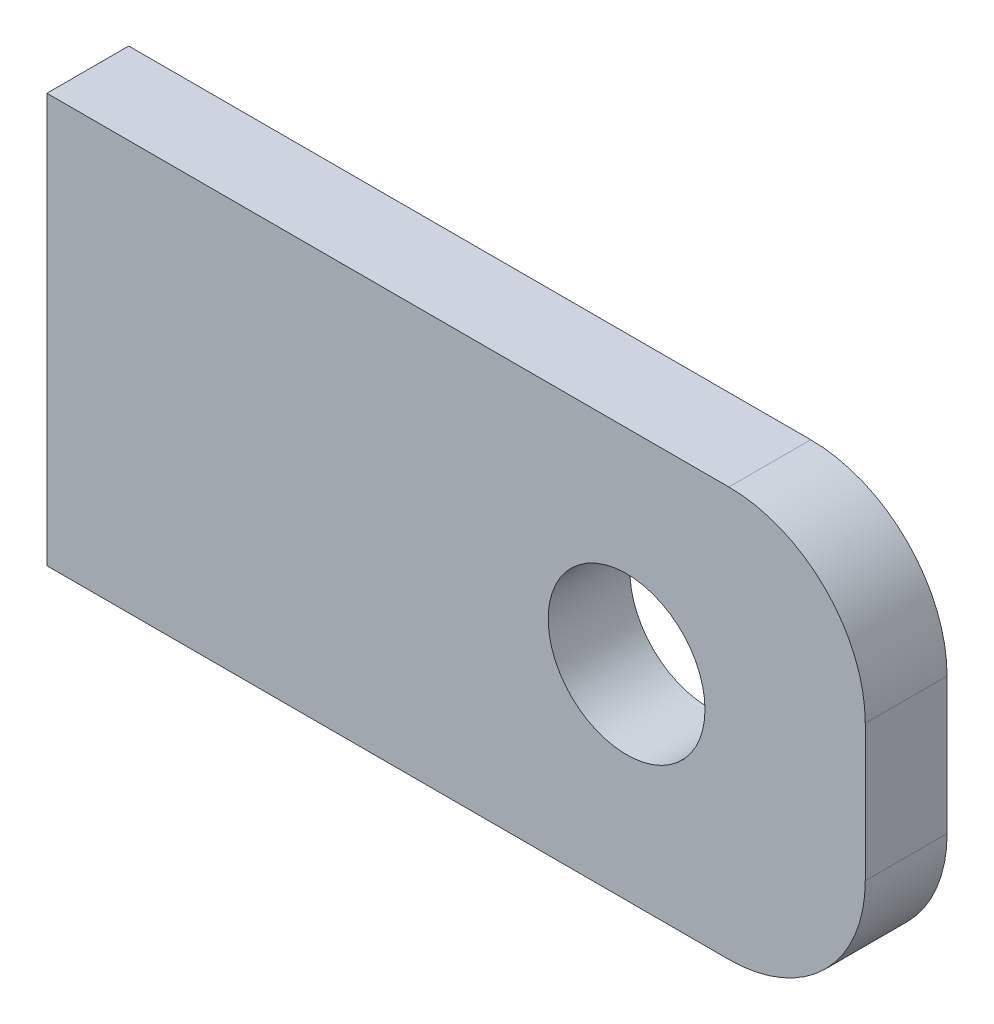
ISO-10303-21;
HEADER;
FILE_DESCRIPTION(('STEP AP214'),'2;1');
FILE_NAME('part.step','',(''),(''),'','','');
FILE_SCHEMA(('AUTOMOTIVE_DESIGN { 1 0 10303 214 1 1 1 1 }'));
ENDSEC;
DATA;
#1=APPLICATION_CONTEXT('core data for automotive mechanical design processes');
#2=APPLICATION_PROTOCOL_DEFINITION('international standard','automotive_design',2000,#1);
#3=PRODUCT_CONTEXT('',#1,'mechanical');
#4=PRODUCT('Part','Part','',(#3));
#5=PRODUCT_RELATED_PRODUCT_CATEGORY('part','',(#4));
#6=PRODUCT_DEFINITION_FORMATION('','',#4);
#7=PRODUCT_DEFINITION_CONTEXT('part definition',#1,'design');
#8=PRODUCT_DEFINITION('design','',#6,#7);
#9=PRODUCT_DEFINITION_SHAPE('','',#8);
#10=(LENGTH_UNIT() NAMED_UNIT(*) SI_UNIT(.MILLI.,.METRE.));
#11=(NAMED_UNIT(*) PLANE_ANGLE_UNIT() SI_UNIT($,.RADIAN.));
#12=(NAMED_UNIT(*) SI_UNIT($,.STERADIAN.) SOLID_ANGLE_UNIT());
#13=UNCERTAINTY_MEASURE_WITH_UNIT(LENGTH_MEASURE(1.E-05),#10,'distance_accuracy_value','');
#14=(GEOMETRIC_REPRESENTATION_CONTEXT(3) GLOBAL_UNCERTAINTY_ASSIGNED_CONTEXT((#13)) GLOBAL_UNIT_ASSIGNED_CONTEXT((#10,
#11,#12)) REPRESENTATION_CONTEXT('',''));
#15=CARTESIAN_POINT('',(0.,0.,0.));
#16=DIRECTION('',(0.,0.,1.));
#17=DIRECTION('',(1.,0.,0.));
#18=AXIS2_PLACEMENT_3D('',#15,#16,#17);
#19=CARTESIAN_POINT('',(100.,-40.,12.));
#20=DIRECTION('',(0.,0.,1.));
#21=DIRECTION('',(1.,0.,0.));
#22=AXIS2_PLACEMENT_3D('',#19,#20,#21);
#23=PLANE('',#22);
#24=DIRECTION('',(0.,-1.,0.));
#25=VECTOR('',#24,1.);
#26=CARTESIAN_POINT('',(0.,0.,12.));
#27=LINE('',#26,#25);
#28=CARTESIAN_POINT('',(0.,0.,12.));
#29=VERTEX_POINT('',#28);
#30=CARTESIAN_POINT('',(0.,-60.,12.));
#31=VERTEX_POINT('',#30);
#32=EDGE_CURVE('E115',#29,#31,#27,.T.);
#33=ORIENTED_EDGE('',*,*,#32,.T.);
#34=DIRECTION('',(1.,0.,0.));
#35=VECTOR('',#34,1.);
#36=CARTESIAN_POINT('',(0.,-60.,12.));
#37=LINE('',#36,#35);
#38=CARTESIAN_POINT('',(99.9999999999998,-60.,12.));
#39=VERTEX_POINT('',#38);
#40=EDGE_CURVE('E96',#31,#39,#37,.T.);
#41=ORIENTED_EDGE('',*,*,#40,.T.);
#42=CARTESIAN_POINT('',(100.,-40.,12.));
#43=DIRECTION('',(0.,0.,1.));
#44=DIRECTION('',(1.,0.,0.));
#45=AXIS2_PLACEMENT_3D('',#42,#43,#44);
#46=CIRCLE('',#45,20.);
#47=CARTESIAN_POINT('',(120.,-39.9999999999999,12.));
#48=VERTEX_POINT('',#47);
#49=EDGE_CURVE('E118',#39,#48,#46,.T.);
#50=ORIENTED_EDGE('',*,*,#49,.T.);
#51=DIRECTION('',(0.,1.,0.));
#52=VECTOR('',#51,1.);
#53=CARTESIAN_POINT('',(120.,-20.0000000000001,12.));
#54=LINE('',#53,#52);
#55=CARTESIAN_POINT('',(120.,-20.0000000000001,12.));
#56=VERTEX_POINT('',#55);
#57=EDGE_CURVE('E120',#48,#56,#54,.T.);
#58=ORIENTED_EDGE('',*,*,#57,.T.);
#59=CARTESIAN_POINT('',(100.,-20.,12.));
#60=DIRECTION('',(0.,0.,1.));
#61=DIRECTION('',(1.,0.,0.));
#62=AXIS2_PLACEMENT_3D('',#59,#60,#61);
#63=CIRCLE('',#62,20.);
#64=CARTESIAN_POINT('',(99.9999999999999,0.,12.));
#65=VERTEX_POINT('',#64);
#66=EDGE_CURVE('E49',#56,#65,#63,.T.);
#67=ORIENTED_EDGE('',*,*,#66,.T.);
#68=DIRECTION('',(-1.,0.,0.));
#69=VECTOR('',#68,1.);
#70=CARTESIAN_POINT('',(0.,0.,12.));
#71=LINE('',#70,#69);
#72=EDGE_CURVE('E44',#65,#29,#71,.T.);
#73=ORIENTED_EDGE('',*,*,#72,.T.);
#74=EDGE_LOOP('',(#33,#41,#50,#58,#67,#73));
#75=FACE_BOUND('',#74,.T.);
#76=CARTESIAN_POINT('',(85.,-30.,12.));
#77=DIRECTION('',(0.,0.,1.));
#78=DIRECTION('',(1.,0.,0.));
#79=AXIS2_PLACEMENT_3D('',#76,#77,#78);
#80=CIRCLE('',#79,11.5);
#81=CARTESIAN_POINT('',(96.5,-30.,12.));
#82=VERTEX_POINT('',#81);
#83=EDGE_CURVE('E101',#82,#82,#80,.T.);
#84=ORIENTED_EDGE('',*,*,#83,.F.);
#85=EDGE_LOOP('',(#84));
#86=FACE_BOUND('',#85,.T.);
#87=ADVANCED_FACE('F29',(#75,#86),#23,.T.);
#88=CARTESIAN_POINT('',(100.,-40.,0.));
#89=DIRECTION('',(0.,0.,1.));
#90=DIRECTION('',(1.,0.,0.));
#91=AXIS2_PLACEMENT_3D('',#88,#89,#90);
#92=PLANE('',#91);
#93=DIRECTION('',(0.,-1.,0.));
#94=VECTOR('',#93,1.);
#95=CARTESIAN_POINT('',(0.,0.,0.));
#96=LINE('',#95,#94);
#97=CARTESIAN_POINT('',(0.,0.,0.));
#98=VERTEX_POINT('',#97);
#99=CARTESIAN_POINT('',(0.,-60.,0.));
#100=VERTEX_POINT('',#99);
#101=EDGE_CURVE('E87',#98,#100,#96,.T.);
#102=ORIENTED_EDGE('',*,*,#101,.F.);
#103=DIRECTION('',(-1.,0.,0.));
#104=VECTOR('',#103,1.);
#105=CARTESIAN_POINT('',(0.,0.,0.));
#106=LINE('',#105,#104);
#107=CARTESIAN_POINT('',(99.9999999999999,0.,0.));
#108=VERTEX_POINT('',#107);
#109=EDGE_CURVE('E113',#108,#98,#106,.T.);
#110=ORIENTED_EDGE('',*,*,#109,.F.);
#111=CARTESIAN_POINT('',(100.,-20.,0.));
#112=DIRECTION('',(0.,0.,1.));
#113=DIRECTION('',(1.,0.,0.));
#114=AXIS2_PLACEMENT_3D('',#111,#112,#113);
#115=CIRCLE('',#114,20.);
#116=CARTESIAN_POINT('',(120.,-20.0000000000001,0.));
#117=VERTEX_POINT('',#116);
#118=EDGE_CURVE('E111',#117,#108,#115,.T.);
#119=ORIENTED_EDGE('',*,*,#118,.F.);
#120=DIRECTION('',(0.,1.,0.));
#121=VECTOR('',#120,1.);
#122=CARTESIAN_POINT('',(120.,-20.0000000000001,0.));
#123=LINE('',#122,#121);
#124=CARTESIAN_POINT('',(120.,-39.9999999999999,0.));
#125=VERTEX_POINT('',#124);
#126=EDGE_CURVE('E109',#125,#117,#123,.T.);
#127=ORIENTED_EDGE('',*,*,#126,.F.);
#128=CARTESIAN_POINT('',(100.,-40.,0.));
#129=DIRECTION('',(0.,0.,1.));
#130=DIRECTION('',(1.,0.,0.));
#131=AXIS2_PLACEMENT_3D('',#128,#129,#130);
#132=CIRCLE('',#131,20.);
#133=CARTESIAN_POINT('',(99.9999999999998,-60.,0.));
#134=VERTEX_POINT('',#133);
#135=EDGE_CURVE('E89',#134,#125,#132,.T.);
#136=ORIENTED_EDGE('',*,*,#135,.F.);
#137=DIRECTION('',(1.,0.,0.));
#138=VECTOR('',#137,1.);
#139=CARTESIAN_POINT('',(0.,-60.,0.));
#140=LINE('',#139,#138);
#141=EDGE_CURVE('E82',#100,#134,#140,.T.);
#142=ORIENTED_EDGE('',*,*,#141,.F.);
#143=EDGE_LOOP('',(#102,#110,#119,#127,#136,#142));
#144=FACE_BOUND('',#143,.T.);
#145=CARTESIAN_POINT('',(85.,-30.,0.));
#146=DIRECTION('',(0.,0.,1.));
#147=DIRECTION('',(1.,0.,0.));
#148=AXIS2_PLACEMENT_3D('',#145,#146,#147);
#149=CIRCLE('',#148,11.5);
#150=CARTESIAN_POINT('',(96.5,-30.,0.));
#151=VERTEX_POINT('',#150);
#152=EDGE_CURVE('E104',#151,#151,#149,.T.);
#153=ORIENTED_EDGE('',*,*,#152,.T.);
#154=EDGE_LOOP('',(#153));
#155=FACE_BOUND('',#154,.T.);
#156=ADVANCED_FACE('F83',(#144,#155),#92,.F.);
#157=CARTESIAN_POINT('',(0.,0.,12.));
#158=DIRECTION('',(1.,0.,0.));
#159=DIRECTION('',(0.,1.,0.));
#160=AXIS2_PLACEMENT_3D('',#157,#158,#159);
#161=PLANE('',#160);
#162=ORIENTED_EDGE('',*,*,#101,.T.);
#163=DIRECTION('',(0.,0.,-1.));
#164=VECTOR('',#163,1.);
#165=CARTESIAN_POINT('',(0.,-60.,12.));
#166=LINE('',#165,#164);
#167=EDGE_CURVE('E11',#31,#100,#166,.T.);
#168=ORIENTED_EDGE('',*,*,#167,.F.);
#169=ORIENTED_EDGE('',*,*,#32,.F.);
#170=DIRECTION('',(0.,0.,-1.));
#171=VECTOR('',#170,1.);
#172=CARTESIAN_POINT('',(0.,0.,12.));
#173=LINE('',#172,#171);
#174=EDGE_CURVE('E100',#29,#98,#173,.T.);
#175=ORIENTED_EDGE('',*,*,#174,.T.);
#176=EDGE_LOOP('',(#162,#168,#169,#175));
#177=FACE_BOUND('',#176,.T.);
#178=ADVANCED_FACE('F31',(#177),#161,.F.);
#179=CARTESIAN_POINT('',(0.,-60.,12.));
#180=DIRECTION('',(0.,1.,0.));
#181=DIRECTION('',(0.,0.,1.));
#182=AXIS2_PLACEMENT_3D('',#179,#180,#181);
#183=PLANE('',#182);
#184=ORIENTED_EDGE('',*,*,#141,.T.);
#185=DIRECTION('',(0.,0.,-1.));
#186=VECTOR('',#185,1.);
#187=CARTESIAN_POINT('',(99.9999999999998,-60.,12.));
#188=LINE('',#187,#186);
#189=EDGE_CURVE('E37',#39,#134,#188,.T.);
#190=ORIENTED_EDGE('',*,*,#189,.F.);
#191=ORIENTED_EDGE('',*,*,#40,.F.);
#192=ORIENTED_EDGE('',*,*,#167,.T.);
#193=EDGE_LOOP('',(#184,#190,#191,#192));
#194=FACE_BOUND('',#193,.T.);
#195=ADVANCED_FACE('F95',(#194),#183,.F.);
#196=CARTESIAN_POINT('',(100.,-40.,12.));
#197=DIRECTION('',(0.,0.,-1.));
#198=DIRECTION('',(-1.,0.,0.));
#199=AXIS2_PLACEMENT_3D('',#196,#197,#198);
#200=CYLINDRICAL_SURFACE('',#199,20.);
#201=ORIENTED_EDGE('',*,*,#135,.T.);
#202=DIRECTION('',(0.,0.,-1.));
#203=VECTOR('',#202,1.);
#204=CARTESIAN_POINT('',(120.,-39.9999999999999,12.));
#205=LINE('',#204,#203);
#206=EDGE_CURVE('E131',#48,#125,#205,.T.);
#207=ORIENTED_EDGE('',*,*,#206,.F.);
#208=ORIENTED_EDGE('',*,*,#49,.F.);
#209=ORIENTED_EDGE('',*,*,#189,.T.);
#210=EDGE_LOOP('',(#201,#207,#208,#209));
#211=FACE_BOUND('',#210,.T.);
#212=ADVANCED_FACE('F135',(#211),#200,.T.);
#213=CARTESIAN_POINT('',(120.,-20.0000000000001,12.));
#214=DIRECTION('',(-1.,0.,0.));
#215=DIRECTION('',(0.,0.,1.));
#216=AXIS2_PLACEMENT_3D('',#213,#214,#215);
#217=PLANE('',#216);
#218=ORIENTED_EDGE('',*,*,#126,.T.);
#219=DIRECTION('',(0.,0.,-1.));
#220=VECTOR('',#219,1.);
#221=CARTESIAN_POINT('',(120.,-20.0000000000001,12.));
#222=LINE('',#221,#220);
#223=EDGE_CURVE('E128',#56,#117,#222,.T.);
#224=ORIENTED_EDGE('',*,*,#223,.F.);
#225=ORIENTED_EDGE('',*,*,#57,.F.);
#226=ORIENTED_EDGE('',*,*,#206,.T.);
#227=EDGE_LOOP('',(#218,#224,#225,#226));
#228=FACE_BOUND('',#227,.T.);
#229=ADVANCED_FACE('F141',(#228),#217,.F.);
#230=CARTESIAN_POINT('',(100.,-20.,12.));
#231=DIRECTION('',(0.,0.,-1.));
#232=DIRECTION('',(-1.,0.,0.));
#233=AXIS2_PLACEMENT_3D('',#230,#231,#232);
#234=CYLINDRICAL_SURFACE('',#233,20.);
#235=ORIENTED_EDGE('',*,*,#118,.T.);
#236=DIRECTION('',(0.,0.,-1.));
#237=VECTOR('',#236,1.);
#238=CARTESIAN_POINT('',(99.9999999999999,0.,12.));
#239=LINE('',#238,#237);
#240=EDGE_CURVE('E125',#65,#108,#239,.T.);
#241=ORIENTED_EDGE('',*,*,#240,.F.);
#242=ORIENTED_EDGE('',*,*,#66,.F.);
#243=ORIENTED_EDGE('',*,*,#223,.T.);
#244=EDGE_LOOP('',(#235,#241,#242,#243));
#245=FACE_BOUND('',#244,.T.);
#246=ADVANCED_FACE('F144',(#245),#234,.T.);
#247=CARTESIAN_POINT('',(0.,0.,12.));
#248=DIRECTION('',(0.,-1.,0.));
#249=DIRECTION('',(0.,0.,-1.));
#250=AXIS2_PLACEMENT_3D('',#247,#248,#249);
#251=PLANE('',#250);
#252=ORIENTED_EDGE('',*,*,#109,.T.);
#253=ORIENTED_EDGE('',*,*,#174,.F.);
#254=ORIENTED_EDGE('',*,*,#72,.F.);
#255=ORIENTED_EDGE('',*,*,#240,.T.);
#256=EDGE_LOOP('',(#252,#253,#254,#255));
#257=FACE_BOUND('',#256,.T.);
#258=ADVANCED_FACE('F146',(#257),#251,.F.);
#259=CARTESIAN_POINT('',(85.,-30.,12.));
#260=DIRECTION('',(0.,0.,-1.));
#261=DIRECTION('',(-1.,0.,0.));
#262=AXIS2_PLACEMENT_3D('',#259,#260,#261);
#263=CYLINDRICAL_SURFACE('',#262,11.5);
#264=ORIENTED_EDGE('',*,*,#83,.T.);
#265=EDGE_LOOP('',(#264));
#266=FACE_BOUND('',#265,.T.);
#267=ORIENTED_EDGE('',*,*,#152,.F.);
#268=EDGE_LOOP('',(#267));
#269=FACE_BOUND('',#268,.T.);
#270=ADVANCED_FACE('F148',(#266,#269),#263,.F.);
#271=CLOSED_SHELL('',(#87,#156,#178,#195,#212,#229,#246,#258,#270));
#272=MANIFOLD_SOLID_BREP('B2',#271);
#273=ADVANCED_BREP_SHAPE_REPRESENTATION('',(#18,#272),#14);
#274=SHAPE_DEFINITION_REPRESENTATION(#9,#273);
ENDSEC;
END-ISO-10303-21;
